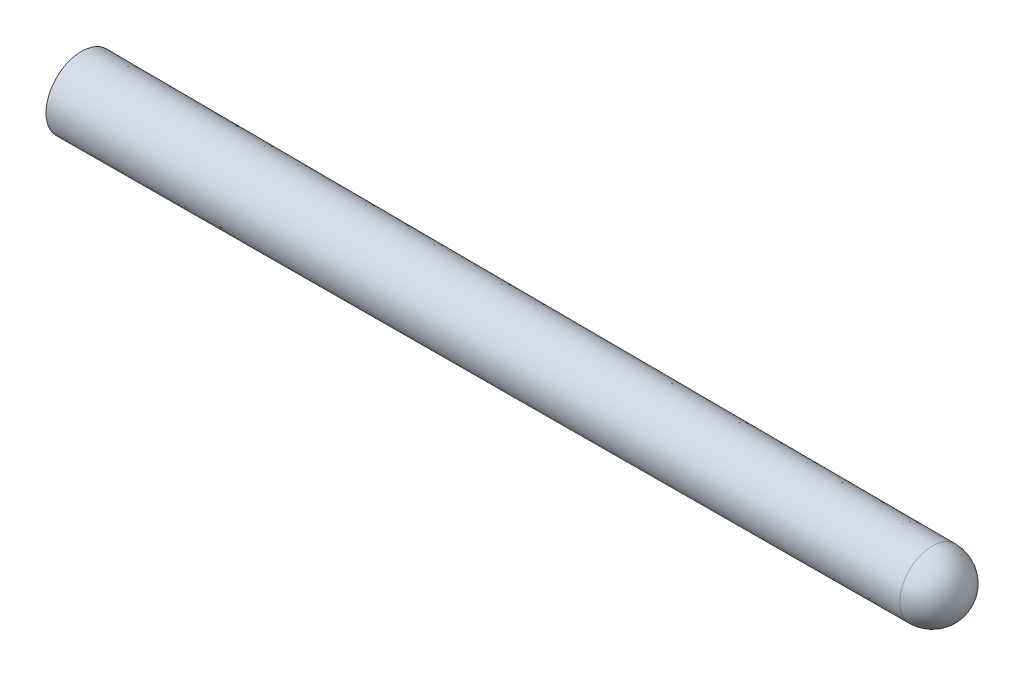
ISO-10303-21;
HEADER;
FILE_DESCRIPTION(('STEP AP214'),'2;1');
FILE_NAME('part.step','',(''),(''),'','','');
FILE_SCHEMA(('AUTOMOTIVE_DESIGN { 1 0 10303 214 1 1 1 1 }'));
ENDSEC;
DATA;
#1=APPLICATION_CONTEXT('core data for automotive mechanical design processes');
#2=APPLICATION_PROTOCOL_DEFINITION('international standard','automotive_design',2000,#1);
#3=PRODUCT_CONTEXT('',#1,'mechanical');
#4=PRODUCT('Part','Part','',(#3));
#5=PRODUCT_RELATED_PRODUCT_CATEGORY('part','',(#4));
#6=PRODUCT_DEFINITION_FORMATION('','',#4);
#7=PRODUCT_DEFINITION_CONTEXT('part definition',#1,'design');
#8=PRODUCT_DEFINITION('design','',#6,#7);
#9=PRODUCT_DEFINITION_SHAPE('','',#8);
#10=(LENGTH_UNIT() NAMED_UNIT(*) SI_UNIT(.MILLI.,.METRE.));
#11=(NAMED_UNIT(*) PLANE_ANGLE_UNIT() SI_UNIT($,.RADIAN.));
#12=(NAMED_UNIT(*) SI_UNIT($,.STERADIAN.) SOLID_ANGLE_UNIT());
#13=UNCERTAINTY_MEASURE_WITH_UNIT(LENGTH_MEASURE(1.E-05),#10,'distance_accuracy_value','');
#14=(GEOMETRIC_REPRESENTATION_CONTEXT(3) GLOBAL_UNCERTAINTY_ASSIGNED_CONTEXT((#13)) GLOBAL_UNIT_ASSIGNED_CONTEXT((#10,
#11,#12)) REPRESENTATION_CONTEXT('',''));
#15=CARTESIAN_POINT('',(0.,0.,0.));
#16=DIRECTION('',(0.,0.,1.));
#17=DIRECTION('',(1.,0.,0.));
#18=AXIS2_PLACEMENT_3D('',#15,#16,#17);
#19=CARTESIAN_POINT('',(200.297104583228,0.,0.));
#20=DIRECTION('',(-1.,0.,0.));
#21=DIRECTION('',(0.,-1.,0.));
#22=AXIS2_PLACEMENT_3D('',#19,#20,#21);
#23=SPHERICAL_SURFACE('',#22,6.3500382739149);
#24=CARTESIAN_POINT('',(200.319151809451,0.,0.));
#25=DIRECTION('',(-1.,0.,0.));
#26=DIRECTION('',(0.,0.,1.));
#27=AXIS2_PLACEMENT_3D('',#24,#25,#26);
#28=CIRCLE('',#27,6.35);
#29=CARTESIAN_POINT('',(200.319151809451,0.,6.35));
#30=VERTEX_POINT('',#29);
#31=EDGE_CURVE('E59',#30,#30,#28,.T.);
#32=ORIENTED_EDGE('',*,*,#31,.F.);
#33=EDGE_LOOP('',(#32));
#34=FACE_BOUND('',#33,.T.);
#35=ADVANCED_FACE('F35',(#34),#23,.T.);
#36=CARTESIAN_POINT('',(200.300619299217,0.,0.00350746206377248));
#37=DIRECTION('',(0.,-1.,0.));
#38=DIRECTION('',(0.,0.,1.));
#39=AXIS2_PLACEMENT_3D('',#36,#37,#38);
#40=CIRCLE('',#39,5.33773038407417);
#41=TRIMMED_CURVE('',#40,(PARAMETER_VALUE(-1.57145343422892)),
(PARAMETER_VALUE(1.57145343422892)),.T.,.PARAMETER.);
#42=CARTESIAN_POINT('',(200.300619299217,0.,0.));
#43=DIRECTION('',(-1.,0.,0.));
#44=AXIS1_PLACEMENT('',#42,#43);
#45=SURFACE_OF_REVOLUTION('',#41,#44);
#46=CARTESIAN_POINT('',(205.638348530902,0.,0.));
#47=VERTEX_POINT('',#46);
#48=VERTEX_LOOP('',#47);
#49=FACE_BOUND('',#48,.T.);
#50=CARTESIAN_POINT('',(200.319151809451,0.,0.));
#51=DIRECTION('',(-1.,0.,0.));
#52=DIRECTION('',(0.,0.,1.));
#53=AXIS2_PLACEMENT_3D('',#50,#51,#52);
#54=CIRCLE('',#53,5.34120567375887);
#55=CARTESIAN_POINT('',(200.319151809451,0.,5.34120567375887));
#56=VERTEX_POINT('',#55);
#57=EDGE_CURVE('E11',#56,#56,#54,.T.);
#58=ORIENTED_EDGE('',*,*,#57,.T.);
#59=EDGE_LOOP('',(#58));
#60=FACE_BOUND('',#59,.T.);
#61=ADVANCED_FACE('F44',(#49,#60),#45,.F.);
#62=CARTESIAN_POINT('',(34.29,0.,0.));
#63=DIRECTION('',(-1.,0.,0.));
#64=DIRECTION('',(0.,0.,1.));
#65=AXIS2_PLACEMENT_3D('',#62,#63,#64);
#66=CONICAL_SURFACE('',#65,5.91765957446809,0.00347199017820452);
#67=ORIENTED_EDGE('',*,*,#57,.F.);
#68=EDGE_LOOP('',(#67));
#69=FACE_BOUND('',#68,.T.);
#70=CARTESIAN_POINT('',(34.29,0.,0.));
#71=DIRECTION('',(-1.,0.,0.));
#72=DIRECTION('',(0.,0.,1.));
#73=AXIS2_PLACEMENT_3D('',#70,#71,#72);
#74=CIRCLE('',#73,5.91765957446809);
#75=CARTESIAN_POINT('',(34.29,0.,5.91765957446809));
#76=VERTEX_POINT('',#75);
#77=EDGE_CURVE('E41',#76,#76,#74,.T.);
#78=ORIENTED_EDGE('',*,*,#77,.T.);
#79=EDGE_LOOP('',(#78));
#80=FACE_BOUND('',#79,.T.);
#81=ADVANCED_FACE('F47',(#69,#80),#66,.F.);
#82=CARTESIAN_POINT('',(34.29,6.92645390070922,0.));
#83=DIRECTION('',(1.,0.,0.));
#84=DIRECTION('',(0.,0.,-1.));
#85=AXIS2_PLACEMENT_3D('',#82,#83,#84);
#86=PLANE('',#85);
#87=ORIENTED_EDGE('',*,*,#77,.F.);
#88=EDGE_LOOP('',(#87));
#89=FACE_BOUND('',#88,.T.);
#90=CARTESIAN_POINT('',(34.29,0.,0.));
#91=DIRECTION('',(-1.,0.,0.));
#92=DIRECTION('',(0.,0.,1.));
#93=AXIS2_PLACEMENT_3D('',#90,#91,#92);
#94=CIRCLE('',#93,6.92645390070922);
#95=CARTESIAN_POINT('',(34.29,0.,6.92645390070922));
#96=VERTEX_POINT('',#95);
#97=EDGE_CURVE('E57',#96,#96,#94,.T.);
#98=ORIENTED_EDGE('',*,*,#97,.T.);
#99=EDGE_LOOP('',(#98));
#100=FACE_BOUND('',#99,.T.);
#101=ADVANCED_FACE('F52',(#89,#100),#86,.F.);
#102=CARTESIAN_POINT('',(200.319151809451,0.,0.));
#103=DIRECTION('',(-1.,0.,0.));
#104=DIRECTION('',(0.,0.,1.));
#105=AXIS2_PLACEMENT_3D('',#102,#103,#104);
#106=CONICAL_SURFACE('',#105,6.35,0.00347199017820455);
#107=ORIENTED_EDGE('',*,*,#97,.F.);
#108=EDGE_LOOP('',(#107));
#109=FACE_BOUND('',#108,.T.);
#110=ORIENTED_EDGE('',*,*,#31,.T.);
#111=EDGE_LOOP('',(#110));
#112=FACE_BOUND('',#111,.T.);
#113=ADVANCED_FACE('F65',(#109,#112),#106,.T.);
#114=CLOSED_SHELL('',(#35,#61,#81,#101,#113));
#115=MANIFOLD_SOLID_BREP('B2',#114);
#116=ADVANCED_BREP_SHAPE_REPRESENTATION('',(#18,#115),#14);
#117=SHAPE_DEFINITION_REPRESENTATION(#9,#116);
ENDSEC;
END-ISO-10303-21;
